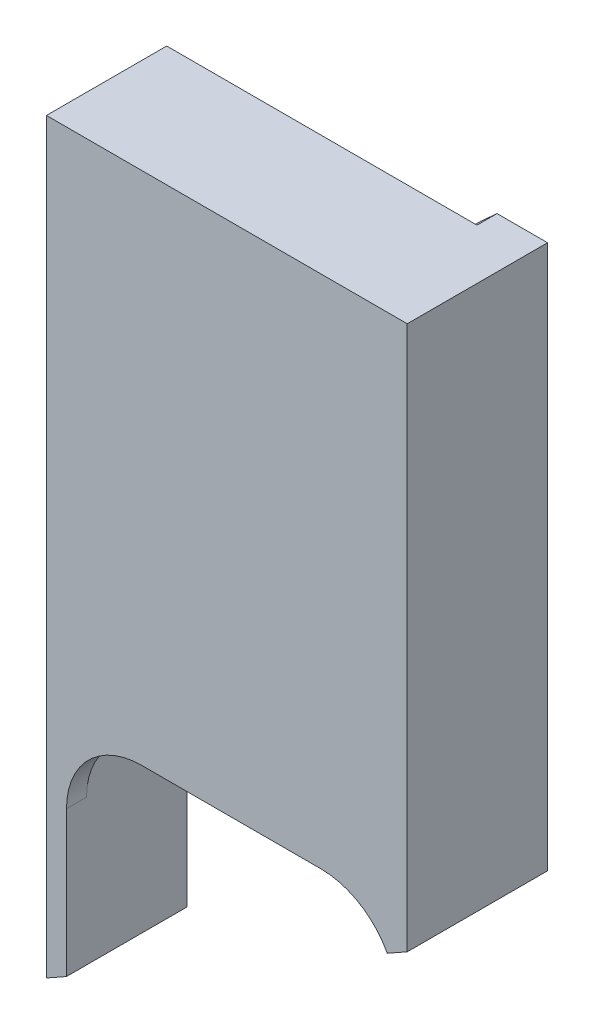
ISO-10303-21;
HEADER;
FILE_DESCRIPTION(('STEP AP214'),'2;1');
FILE_NAME('part.step','',(''),(''),'','','');
FILE_SCHEMA(('AUTOMOTIVE_DESIGN { 1 0 10303 214 1 1 1 1 }'));
ENDSEC;
DATA;
#1=APPLICATION_CONTEXT('core data for automotive mechanical design processes');
#2=APPLICATION_PROTOCOL_DEFINITION('international standard','automotive_design',2000,#1);
#3=PRODUCT_CONTEXT('',#1,'mechanical');
#4=PRODUCT('Part','Part','',(#3));
#5=PRODUCT_RELATED_PRODUCT_CATEGORY('part','',(#4));
#6=PRODUCT_DEFINITION_FORMATION('','',#4);
#7=PRODUCT_DEFINITION_CONTEXT('part definition',#1,'design');
#8=PRODUCT_DEFINITION('design','',#6,#7);
#9=PRODUCT_DEFINITION_SHAPE('','',#8);
#10=(LENGTH_UNIT() NAMED_UNIT(*) SI_UNIT(.MILLI.,.METRE.));
#11=(NAMED_UNIT(*) PLANE_ANGLE_UNIT() SI_UNIT($,.RADIAN.));
#12=(NAMED_UNIT(*) SI_UNIT($,.STERADIAN.) SOLID_ANGLE_UNIT());
#13=UNCERTAINTY_MEASURE_WITH_UNIT(LENGTH_MEASURE(1.E-05),#10,'distance_accuracy_value','');
#14=(GEOMETRIC_REPRESENTATION_CONTEXT(3) GLOBAL_UNCERTAINTY_ASSIGNED_CONTEXT((#13)) GLOBAL_UNIT_ASSIGNED_CONTEXT((#10,
#11,#12)) REPRESENTATION_CONTEXT('',''));
#15=CARTESIAN_POINT('',(0.,0.,0.));
#16=DIRECTION('',(0.,0.,1.));
#17=DIRECTION('',(1.,0.,0.));
#18=AXIS2_PLACEMENT_3D('',#15,#16,#17);
#19=CARTESIAN_POINT('',(-22.86,-94.6581864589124,-16.51));
#20=DIRECTION('',(-0.490481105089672,0.871451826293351,0.));
#21=DIRECTION('',(-0.871451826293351,-0.490481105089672,0.));
#22=AXIS2_PLACEMENT_3D('',#19,#20,#21);
#23=PLANE('',#22);
#24=DIRECTION('',(-0.871451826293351,-0.490481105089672,0.));
#25=VECTOR('',#24,1.);
#26=CARTESIAN_POINT('',(-22.86,-94.6581864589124,1.27000000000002));
#27=LINE('',#26,#25);
#28=CARTESIAN_POINT('',(22.86,-68.9255005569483,1.27000000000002));
#29=VERTEX_POINT('',#28);
#30=CARTESIAN_POINT('',(20.32,-70.3550942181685,1.27000000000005));
#31=VERTEX_POINT('',#30);
#32=EDGE_CURVE('E168',#29,#31,#27,.T.);
#33=ORIENTED_EDGE('',*,*,#32,.T.);
#34=DIRECTION('',(0.,0.,0.999999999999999));
#35=VECTOR('',#34,1.);
#36=CARTESIAN_POINT('',(20.32,-70.3550942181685,-13.97));
#37=LINE('',#36,#35);
#38=CARTESIAN_POINT('',(20.32,-70.3550942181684,-1.26999999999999));
#39=VERTEX_POINT('',#38);
#40=EDGE_CURVE('E179',#39,#31,#37,.T.);
#41=ORIENTED_EDGE('',*,*,#40,.F.);
#42=CARTESIAN_POINT('',(20.32,-70.3550942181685,-13.97));
#43=VERTEX_POINT('',#42);
#44=EDGE_CURVE('E188',#43,#39,#37,.T.);
#45=ORIENTED_EDGE('',*,*,#44,.F.);
#46=DIRECTION('',(0.871451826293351,0.490481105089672,0.));
#47=VECTOR('',#46,1.);
#48=CARTESIAN_POINT('',(55.7355757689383,-50.4220695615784,-13.97));
#49=LINE('',#48,#47);
#50=CARTESIAN_POINT('',(11.1720317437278,-75.5038648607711,-13.97));
#51=VERTEX_POINT('',#50);
#52=EDGE_CURVE('E189',#51,#43,#49,.T.);
#53=ORIENTED_EDGE('',*,*,#52,.F.);
#54=DIRECTION('',(0.,0.,1.));
#55=VECTOR('',#54,1.);
#56=CARTESIAN_POINT('',(11.1720317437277,-75.5038648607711,-16.51));
#57=LINE('',#56,#55);
#58=CARTESIAN_POINT('',(11.1720317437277,-75.5038648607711,-16.51));
#59=VERTEX_POINT('',#58);
#60=EDGE_CURVE('E193',#59,#51,#57,.T.);
#61=ORIENTED_EDGE('',*,*,#60,.F.);
#62=DIRECTION('',(-0.871451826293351,-0.490481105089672,0.));
#63=VECTOR('',#62,1.);
#64=CARTESIAN_POINT('',(-22.86,-94.6581864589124,-16.51));
#65=LINE('',#64,#63);
#66=CARTESIAN_POINT('',(22.86,-68.9255005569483,-16.51));
#67=VERTEX_POINT('',#66);
#68=EDGE_CURVE('E183',#67,#59,#65,.T.);
#69=ORIENTED_EDGE('',*,*,#68,.F.);
#70=DIRECTION('',(0.,0.,1.));
#71=VECTOR('',#70,1.);
#72=CARTESIAN_POINT('',(22.86,-68.9255005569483,-16.51));
#73=LINE('',#72,#71);
#74=EDGE_CURVE('E182',#67,#29,#73,.T.);
#75=ORIENTED_EDGE('',*,*,#74,.T.);
#76=EDGE_LOOP('',(#33,#41,#45,#53,#61,#69,#75));
#77=FACE_BOUND('',#76,.T.);
#78=ADVANCED_FACE('F34',(#77),#23,.F.);
#79=CARTESIAN_POINT('',(22.86,-57.1500000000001,-1.26999999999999));
#80=DIRECTION('',(0.,0.,1.));
#81=DIRECTION('',(0.,-1.,0.));
#82=AXIS2_PLACEMENT_3D('',#79,#80,#81);
#83=PLANE('',#82);
#84=DIRECTION('',(0.,1.,0.));
#85=VECTOR('',#84,1.);
#86=CARTESIAN_POINT('',(20.32,-2.54000000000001,-1.26999999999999));
#87=LINE('',#86,#85);
#88=CARTESIAN_POINT('',(20.32,-57.1500000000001,-1.26999999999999));
#89=VERTEX_POINT('',#88);
#90=EDGE_CURVE('E240',#39,#89,#87,.T.);
#91=ORIENTED_EDGE('',*,*,#90,.F.);
#92=CARTESIAN_POINT('',(11.9029093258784,-74.8135927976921,-1.26999999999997));
#93=DIRECTION('',(0.,0.,1.));
#94=DIRECTION('',(0.,-1.,0.));
#95=AXIS2_PLACEMENT_3D('',#92,#93,#94);
#96=CIRCLE('',#95,9.525);
#97=CARTESIAN_POINT('',(11.9029093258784,-65.2885927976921,-1.26999999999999));
#98=VERTEX_POINT('',#97);
#99=EDGE_CURVE('E175',#39,#98,#96,.T.);
#100=ORIENTED_EDGE('',*,*,#99,.T.);
#101=DIRECTION('',(1.,0.,0.));
#102=VECTOR('',#101,1.);
#103=CARTESIAN_POINT('',(-20.32,-65.2885927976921,-1.26999999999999));
#104=LINE('',#103,#102);
#105=CARTESIAN_POINT('',(-10.795,-65.2885927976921,-1.26999999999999));
#106=VERTEX_POINT('',#105);
#107=EDGE_CURVE('E306',#106,#98,#104,.T.);
#108=ORIENTED_EDGE('',*,*,#107,.F.);
#109=CARTESIAN_POINT('',(-10.795,-74.8135927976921,-1.26999999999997));
#110=DIRECTION('',(0.,0.,1.));
#111=DIRECTION('',(0.,-1.,0.));
#112=AXIS2_PLACEMENT_3D('',#109,#110,#111);
#113=CIRCLE('',#112,9.525);
#114=CARTESIAN_POINT('',(-20.32,-74.8135927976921,-1.26999999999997));
#115=VERTEX_POINT('',#114);
#116=EDGE_CURVE('E42',#106,#115,#113,.T.);
#117=ORIENTED_EDGE('',*,*,#116,.T.);
#118=DIRECTION('',(0.,-1.,0.));
#119=VECTOR('',#118,1.);
#120=CARTESIAN_POINT('',(-20.32,-107.95,-1.27000000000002));
#121=LINE('',#120,#119);
#122=CARTESIAN_POINT('',(-20.32,-57.1500000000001,-1.26999999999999));
#123=VERTEX_POINT('',#122);
#124=EDGE_CURVE('E49',#123,#115,#121,.T.);
#125=ORIENTED_EDGE('',*,*,#124,.F.);
#126=DIRECTION('',(-1.,0.,0.));
#127=VECTOR('',#126,1.);
#128=CARTESIAN_POINT('',(22.86,-57.1500000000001,-1.26999999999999));
#129=LINE('',#128,#127);
#130=EDGE_CURVE('E289',#89,#123,#129,.T.);
#131=ORIENTED_EDGE('',*,*,#130,.F.);
#132=EDGE_LOOP('',(#91,#100,#108,#117,#125,#131));
#133=FACE_BOUND('',#132,.T.);
#134=ADVANCED_FACE('F303',(#133),#83,.F.);
#135=CARTESIAN_POINT('',(22.86,-57.1500000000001,-3.17499999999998));
#136=DIRECTION('',(0.,1.,0.));
#137=DIRECTION('',(0.,0.,1.));
#138=AXIS2_PLACEMENT_3D('',#135,#136,#137);
#139=PLANE('',#138);
#140=DIRECTION('',(0.,0.,-1.));
#141=VECTOR('',#140,1.);
#142=CARTESIAN_POINT('',(20.32,-57.1500000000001,-3.17499999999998));
#143=LINE('',#142,#141);
#144=CARTESIAN_POINT('',(20.32,-57.1500000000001,-3.17499999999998));
#145=VERTEX_POINT('',#144);
#146=EDGE_CURVE('E266',#89,#145,#143,.T.);
#147=ORIENTED_EDGE('',*,*,#146,.F.);
#148=ORIENTED_EDGE('',*,*,#130,.T.);
#149=DIRECTION('',(0.,0.,1.));
#150=VECTOR('',#149,1.);
#151=CARTESIAN_POINT('',(-20.32,-57.1500000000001,-3.17499999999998));
#152=LINE('',#151,#150);
#153=CARTESIAN_POINT('',(-20.32,-57.1500000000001,-3.17499999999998));
#154=VERTEX_POINT('',#153);
#155=EDGE_CURVE('E258',#154,#123,#152,.T.);
#156=ORIENTED_EDGE('',*,*,#155,.F.);
#157=DIRECTION('',(-1.,0.,0.));
#158=VECTOR('',#157,1.);
#159=CARTESIAN_POINT('',(22.86,-57.1500000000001,-3.17499999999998));
#160=LINE('',#159,#158);
#161=EDGE_CURVE('E286',#145,#154,#160,.T.);
#162=ORIENTED_EDGE('',*,*,#161,.F.);
#163=EDGE_LOOP('',(#147,#148,#156,#162));
#164=FACE_BOUND('',#163,.T.);
#165=ADVANCED_FACE('F378',(#164),#139,.F.);
#166=CARTESIAN_POINT('',(22.86,-34.29,-3.17499999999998));
#167=DIRECTION('',(0.,0.,1.));
#168=DIRECTION('',(0.,-1.,0.));
#169=AXIS2_PLACEMENT_3D('',#166,#167,#168);
#170=PLANE('',#169);
#171=DIRECTION('',(0.,1.,0.));
#172=VECTOR('',#171,1.);
#173=CARTESIAN_POINT('',(20.32,-34.29,-3.17499999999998));
#174=LINE('',#173,#172);
#175=CARTESIAN_POINT('',(20.32,-34.29,-3.17499999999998));
#176=VERTEX_POINT('',#175);
#177=EDGE_CURVE('E263',#145,#176,#174,.T.);
#178=ORIENTED_EDGE('',*,*,#177,.F.);
#179=ORIENTED_EDGE('',*,*,#161,.T.);
#180=DIRECTION('',(0.,-1.,0.));
#181=VECTOR('',#180,1.);
#182=CARTESIAN_POINT('',(-20.32,-34.29,-3.17499999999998));
#183=LINE('',#182,#181);
#184=CARTESIAN_POINT('',(-20.32,-34.29,-3.17499999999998));
#185=VERTEX_POINT('',#184);
#186=EDGE_CURVE('E255',#185,#154,#183,.T.);
#187=ORIENTED_EDGE('',*,*,#186,.F.);
#188=DIRECTION('',(-1.,0.,0.));
#189=VECTOR('',#188,1.);
#190=CARTESIAN_POINT('',(22.86,-34.29,-3.17499999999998));
#191=LINE('',#190,#189);
#192=EDGE_CURVE('E283',#176,#185,#191,.T.);
#193=ORIENTED_EDGE('',*,*,#192,.F.);
#194=EDGE_LOOP('',(#178,#179,#187,#193));
#195=FACE_BOUND('',#194,.T.);
#196=ADVANCED_FACE('F374',(#195),#170,.F.);
#197=CARTESIAN_POINT('',(22.86,-34.29,-1.26999999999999));
#198=DIRECTION('',(0.,-1.,0.));
#199=DIRECTION('',(0.,0.,-1.));
#200=AXIS2_PLACEMENT_3D('',#197,#198,#199);
#201=PLANE('',#200);
#202=DIRECTION('',(0.,0.,1.));
#203=VECTOR('',#202,1.);
#204=CARTESIAN_POINT('',(20.32,-34.29,-1.26999999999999));
#205=LINE('',#204,#203);
#206=CARTESIAN_POINT('',(20.32,-34.29,-1.26999999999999));
#207=VERTEX_POINT('',#206);
#208=EDGE_CURVE('E260',#176,#207,#205,.T.);
#209=ORIENTED_EDGE('',*,*,#208,.F.);
#210=ORIENTED_EDGE('',*,*,#192,.T.);
#211=DIRECTION('',(0.,0.,-1.));
#212=VECTOR('',#211,1.);
#213=CARTESIAN_POINT('',(-20.32,-34.29,-1.26999999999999));
#214=LINE('',#213,#212);
#215=CARTESIAN_POINT('',(-20.32,-34.29,-1.26999999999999));
#216=VERTEX_POINT('',#215);
#217=EDGE_CURVE('E252',#216,#185,#214,.T.);
#218=ORIENTED_EDGE('',*,*,#217,.F.);
#219=DIRECTION('',(-1.,0.,0.));
#220=VECTOR('',#219,1.);
#221=CARTESIAN_POINT('',(22.86,-34.29,-1.26999999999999));
#222=LINE('',#221,#220);
#223=EDGE_CURVE('E276',#207,#216,#222,.T.);
#224=ORIENTED_EDGE('',*,*,#223,.F.);
#225=EDGE_LOOP('',(#209,#210,#218,#224));
#226=FACE_BOUND('',#225,.T.);
#227=ADVANCED_FACE('F372',(#226),#201,.F.);
#228=CARTESIAN_POINT('',(22.86,0.,-1.26999999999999));
#229=DIRECTION('',(0.,0.,1.));
#230=DIRECTION('',(0.,-1.,0.));
#231=AXIS2_PLACEMENT_3D('',#228,#229,#230);
#232=PLANE('',#231);
#233=CARTESIAN_POINT('',(20.32,-2.54000000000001,-1.26999999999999));
#234=VERTEX_POINT('',#233);
#235=EDGE_CURVE('E224',#207,#234,#87,.T.);
#236=ORIENTED_EDGE('',*,*,#235,.F.);
#237=ORIENTED_EDGE('',*,*,#223,.T.);
#238=CARTESIAN_POINT('',(-20.32,-2.54,-1.26999999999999));
#239=VERTEX_POINT('',#238);
#240=EDGE_CURVE('E228',#239,#216,#121,.T.);
#241=ORIENTED_EDGE('',*,*,#240,.F.);
#242=DIRECTION('',(-1.,0.,0.));
#243=VECTOR('',#242,1.);
#244=CARTESIAN_POINT('',(-20.32,-2.54,-1.26999999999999));
#245=LINE('',#244,#243);
#246=EDGE_CURVE('E242',#234,#239,#245,.T.);
#247=ORIENTED_EDGE('',*,*,#246,.F.);
#248=EDGE_LOOP('',(#236,#237,#241,#247));
#249=FACE_BOUND('',#248,.T.);
#250=ADVANCED_FACE('F366',(#249),#232,.F.);
#251=CARTESIAN_POINT('',(22.86,0.,1.27000000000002));
#252=DIRECTION('',(0.,-1.,0.));
#253=DIRECTION('',(0.,0.,-1.));
#254=AXIS2_PLACEMENT_3D('',#251,#252,#253);
#255=PLANE('',#254);
#256=DIRECTION('',(0.,0.,1.));
#257=VECTOR('',#256,1.);
#258=CARTESIAN_POINT('',(-22.86,0.,1.26999999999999));
#259=LINE('',#258,#257);
#260=CARTESIAN_POINT('',(-22.86,0.,-13.97));
#261=VERTEX_POINT('',#260);
#262=CARTESIAN_POINT('',(-22.86,0.,1.26999999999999));
#263=VERTEX_POINT('',#262);
#264=EDGE_CURVE('E269',#261,#263,#259,.T.);
#265=ORIENTED_EDGE('',*,*,#264,.T.);
#266=DIRECTION('',(-1.,0.,0.));
#267=VECTOR('',#266,1.);
#268=CARTESIAN_POINT('',(22.86,0.,1.27000000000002));
#269=LINE('',#268,#267);
#270=CARTESIAN_POINT('',(22.86,0.,1.27000000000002));
#271=VERTEX_POINT('',#270);
#272=EDGE_CURVE('E292',#271,#263,#269,.T.);
#273=ORIENTED_EDGE('',*,*,#272,.F.);
#274=DIRECTION('',(0.,0.,1.));
#275=VECTOR('',#274,1.);
#276=CARTESIAN_POINT('',(22.86,0.,1.27000000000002));
#277=LINE('',#276,#275);
#278=CARTESIAN_POINT('',(22.86,0.,-16.51));
#279=VERTEX_POINT('',#278);
#280=EDGE_CURVE('E270',#279,#271,#277,.T.);
#281=ORIENTED_EDGE('',*,*,#280,.F.);
#282=DIRECTION('',(1.,0.,0.));
#283=VECTOR('',#282,1.);
#284=CARTESIAN_POINT('',(22.86,0.,-16.51));
#285=LINE('',#284,#283);
#286=CARTESIAN_POINT('',(16.4584053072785,0.,-16.51));
#287=VERTEX_POINT('',#286);
#288=EDGE_CURVE('E208',#287,#279,#285,.T.);
#289=ORIENTED_EDGE('',*,*,#288,.F.);
#290=DIRECTION('',(0.,0.,1.));
#291=VECTOR('',#290,1.);
#292=CARTESIAN_POINT('',(16.4584053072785,0.,-16.51));
#293=LINE('',#292,#291);
#294=CARTESIAN_POINT('',(16.4584053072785,0.,-13.97));
#295=VERTEX_POINT('',#294);
#296=EDGE_CURVE('E214',#287,#295,#293,.T.);
#297=ORIENTED_EDGE('',*,*,#296,.T.);
#298=DIRECTION('',(1.,0.,0.));
#299=VECTOR('',#298,1.);
#300=CARTESIAN_POINT('',(22.86,0.,-13.97));
#301=LINE('',#300,#299);
#302=EDGE_CURVE('E237',#261,#295,#301,.T.);
#303=ORIENTED_EDGE('',*,*,#302,.F.);
#304=EDGE_LOOP('',(#265,#273,#281,#289,#297,#303));
#305=FACE_BOUND('',#304,.T.);
#306=ADVANCED_FACE('F349',(#305),#255,.F.);
#307=CARTESIAN_POINT('',(22.86,0.,1.27000000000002));
#308=DIRECTION('',(0.,0.,-1.));
#309=DIRECTION('',(0.,1.,0.));
#310=AXIS2_PLACEMENT_3D('',#307,#308,#309);
#311=PLANE('',#310);
#312=DIRECTION('',(0.,1.,0.));
#313=VECTOR('',#312,1.);
#314=CARTESIAN_POINT('',(-20.32,-93.2285927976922,1.27000000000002));
#315=LINE('',#314,#313);
#316=CARTESIAN_POINT('',(-20.32,-93.2285927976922,1.27000000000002));
#317=VERTEX_POINT('',#316);
#318=CARTESIAN_POINT('',(-20.32,-74.8135927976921,1.27000000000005));
#319=VERTEX_POINT('',#318);
#320=EDGE_CURVE('E311',#317,#319,#315,.T.);
#321=ORIENTED_EDGE('',*,*,#320,.T.);
#322=CARTESIAN_POINT('',(-10.795,-74.8135927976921,1.27000000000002));
#323=DIRECTION('',(0.,0.,-1.));
#324=DIRECTION('',(0.,1.,0.));
#325=AXIS2_PLACEMENT_3D('',#322,#323,#324);
#326=CIRCLE('',#325,9.525);
#327=CARTESIAN_POINT('',(-10.795,-65.2885927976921,1.27000000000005));
#328=VERTEX_POINT('',#327);
#329=EDGE_CURVE('E11',#319,#328,#326,.T.);
#330=ORIENTED_EDGE('',*,*,#329,.T.);
#331=DIRECTION('',(1.,0.,0.));
#332=VECTOR('',#331,1.);
#333=CARTESIAN_POINT('',(-20.32,-65.2885927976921,1.27000000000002));
#334=LINE('',#333,#332);
#335=CARTESIAN_POINT('',(11.9029093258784,-65.2885927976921,1.27000000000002));
#336=VERTEX_POINT('',#335);
#337=EDGE_CURVE('E171',#328,#336,#334,.T.);
#338=ORIENTED_EDGE('',*,*,#337,.T.);
#339=CARTESIAN_POINT('',(11.9029093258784,-74.8135927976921,1.27000000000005));
#340=DIRECTION('',(0.,0.,-1.));
#341=DIRECTION('',(0.,1.,0.));
#342=AXIS2_PLACEMENT_3D('',#339,#340,#341);
#343=CIRCLE('',#342,9.525);
#344=EDGE_CURVE('E165',#336,#31,#343,.T.);
#345=ORIENTED_EDGE('',*,*,#344,.T.);
#346=ORIENTED_EDGE('',*,*,#32,.F.);
#347=DIRECTION('',(0.,-1.,0.));
#348=VECTOR('',#347,1.);
#349=CARTESIAN_POINT('',(22.86,0.,1.27000000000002));
#350=LINE('',#349,#348);
#351=EDGE_CURVE('E273',#271,#29,#350,.T.);
#352=ORIENTED_EDGE('',*,*,#351,.F.);
#353=ORIENTED_EDGE('',*,*,#272,.T.);
#354=DIRECTION('',(0.,-1.,0.));
#355=VECTOR('',#354,1.);
#356=CARTESIAN_POINT('',(-22.86,0.,1.26999999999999));
#357=LINE('',#356,#355);
#358=CARTESIAN_POINT('',(-22.86,-94.6581864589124,1.27000000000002));
#359=VERTEX_POINT('',#358);
#360=EDGE_CURVE('E274',#263,#359,#357,.T.);
#361=ORIENTED_EDGE('',*,*,#360,.T.);
#362=EDGE_CURVE('E184',#317,#359,#27,.T.);
#363=ORIENTED_EDGE('',*,*,#362,.F.);
#364=EDGE_LOOP('',(#321,#330,#338,#345,#346,#352,#353,#361,#363));
#365=FACE_BOUND('',#364,.T.);
#366=ADVANCED_FACE('F167',(#365),#311,.F.);
#367=CARTESIAN_POINT('',(22.86,0.,0.));
#368=DIRECTION('',(-1.,0.,0.));
#369=DIRECTION('',(0.,0.,1.));
#370=AXIS2_PLACEMENT_3D('',#367,#368,#369);
#371=PLANE('',#370);
#372=ORIENTED_EDGE('',*,*,#351,.T.);
#373=ORIENTED_EDGE('',*,*,#74,.F.);
#374=DIRECTION('',(0.,-1.,0.));
#375=VECTOR('',#374,1.);
#376=CARTESIAN_POINT('',(22.86,-107.95,-16.51));
#377=LINE('',#376,#375);
#378=EDGE_CURVE('E211',#279,#67,#377,.T.);
#379=ORIENTED_EDGE('',*,*,#378,.F.);
#380=ORIENTED_EDGE('',*,*,#280,.T.);
#381=EDGE_LOOP('',(#372,#373,#379,#380));
#382=FACE_BOUND('',#381,.T.);
#383=ADVANCED_FACE('F344',(#382),#371,.F.);
#384=CARTESIAN_POINT('',(-22.86,0.,0.));
#385=DIRECTION('',(-1.,0.,0.));
#386=DIRECTION('',(0.,0.,1.));
#387=AXIS2_PLACEMENT_3D('',#384,#385,#386);
#388=PLANE('',#387);
#389=DIRECTION('',(0.,0.,1.));
#390=VECTOR('',#389,1.);
#391=CARTESIAN_POINT('',(-22.86,-94.6581864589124,-16.51));
#392=LINE('',#391,#390);
#393=CARTESIAN_POINT('',(-22.86,-94.6581864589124,-13.97));
#394=VERTEX_POINT('',#393);
#395=EDGE_CURVE('E320',#394,#359,#392,.T.);
#396=ORIENTED_EDGE('',*,*,#395,.T.);
#397=ORIENTED_EDGE('',*,*,#360,.F.);
#398=ORIENTED_EDGE('',*,*,#264,.F.);
#399=DIRECTION('',(0.,1.,0.));
#400=VECTOR('',#399,1.);
#401=CARTESIAN_POINT('',(-22.86,0.,-13.97));
#402=LINE('',#401,#400);
#403=EDGE_CURVE('E235',#394,#261,#402,.T.);
#404=ORIENTED_EDGE('',*,*,#403,.F.);
#405=EDGE_LOOP('',(#396,#397,#398,#404));
#406=FACE_BOUND('',#405,.T.);
#407=ADVANCED_FACE('F352',(#406),#388,.T.);
#408=CARTESIAN_POINT('',(20.32,-2.54000000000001,-13.97));
#409=DIRECTION('',(1.,0.,0.));
#410=DIRECTION('',(0.,1.,0.));
#411=AXIS2_PLACEMENT_3D('',#408,#409,#410);
#412=PLANE('',#411);
#413=ORIENTED_EDGE('',*,*,#44,.T.);
#414=ORIENTED_EDGE('',*,*,#90,.T.);
#415=ORIENTED_EDGE('',*,*,#146,.T.);
#416=ORIENTED_EDGE('',*,*,#177,.T.);
#417=ORIENTED_EDGE('',*,*,#208,.T.);
#418=ORIENTED_EDGE('',*,*,#235,.T.);
#419=DIRECTION('',(0.,0.,1.));
#420=VECTOR('',#419,1.);
#421=CARTESIAN_POINT('',(20.32,-2.54000000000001,-13.97));
#422=LINE('',#421,#420);
#423=CARTESIAN_POINT('',(20.32,-2.54000000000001,-13.97));
#424=VERTEX_POINT('',#423);
#425=EDGE_CURVE('E249',#424,#234,#422,.T.);
#426=ORIENTED_EDGE('',*,*,#425,.F.);
#427=DIRECTION('',(0.,1.,0.));
#428=VECTOR('',#427,1.);
#429=CARTESIAN_POINT('',(20.32,-2.54000000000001,-13.97));
#430=LINE('',#429,#428);
#431=EDGE_CURVE('E225',#43,#424,#430,.T.);
#432=ORIENTED_EDGE('',*,*,#431,.F.);
#433=EDGE_LOOP('',(#413,#414,#415,#416,#417,#418,#426,#432));
#434=FACE_BOUND('',#433,.T.);
#435=ADVANCED_FACE('F369',(#434),#412,.F.);
#436=CARTESIAN_POINT('',(-20.32,-107.95,-13.97));
#437=DIRECTION('',(-1.,0.,0.));
#438=DIRECTION('',(0.,0.,1.));
#439=AXIS2_PLACEMENT_3D('',#436,#437,#438);
#440=PLANE('',#439);
#441=ORIENTED_EDGE('',*,*,#124,.T.);
#442=DIRECTION('',(0.,0.,-1.));
#443=VECTOR('',#442,1.);
#444=CARTESIAN_POINT('',(-20.32,-74.8135927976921,1.27000000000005));
#445=LINE('',#444,#443);
#446=EDGE_CURVE('E54',#115,#319,#445,.F.);
#447=ORIENTED_EDGE('',*,*,#446,.T.);
#448=ORIENTED_EDGE('',*,*,#320,.F.);
#449=DIRECTION('',(0.,0.,-0.999999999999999));
#450=VECTOR('',#449,1.);
#451=CARTESIAN_POINT('',(-20.32,-93.2285927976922,-13.97));
#452=LINE('',#451,#450);
#453=CARTESIAN_POINT('',(-20.32,-93.2285927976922,-13.97));
#454=VERTEX_POINT('',#453);
#455=EDGE_CURVE('E191',#317,#454,#452,.T.);
#456=ORIENTED_EDGE('',*,*,#455,.T.);
#457=DIRECTION('',(0.,-1.,0.));
#458=VECTOR('',#457,1.);
#459=CARTESIAN_POINT('',(-20.32,-107.95,-13.97));
#460=LINE('',#459,#458);
#461=CARTESIAN_POINT('',(-20.32,-2.53999999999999,-13.97));
#462=VERTEX_POINT('',#461);
#463=EDGE_CURVE('E232',#462,#454,#460,.T.);
#464=ORIENTED_EDGE('',*,*,#463,.F.);
#465=DIRECTION('',(0.,0.,1.));
#466=VECTOR('',#465,1.);
#467=CARTESIAN_POINT('',(-20.32,-2.53999999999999,-13.97));
#468=LINE('',#467,#466);
#469=EDGE_CURVE('E239',#462,#239,#468,.T.);
#470=ORIENTED_EDGE('',*,*,#469,.T.);
#471=ORIENTED_EDGE('',*,*,#240,.T.);
#472=ORIENTED_EDGE('',*,*,#217,.T.);
#473=ORIENTED_EDGE('',*,*,#186,.T.);
#474=ORIENTED_EDGE('',*,*,#155,.T.);
#475=EDGE_LOOP('',(#441,#447,#448,#456,#464,#470,#471,#472,#473,#474));
#476=FACE_BOUND('',#475,.T.);
#477=ADVANCED_FACE('F360',(#476),#440,.F.);
#478=CARTESIAN_POINT('',(-20.32,-2.53999999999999,-13.97));
#479=DIRECTION('',(0.,1.,0.));
#480=DIRECTION('',(-1.,0.,0.));
#481=AXIS2_PLACEMENT_3D('',#478,#479,#480);
#482=PLANE('',#481);
#483=ORIENTED_EDGE('',*,*,#246,.T.);
#484=ORIENTED_EDGE('',*,*,#469,.F.);
#485=DIRECTION('',(-1.,0.,0.));
#486=VECTOR('',#485,1.);
#487=CARTESIAN_POINT('',(-20.32,-2.53999999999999,-13.97));
#488=LINE('',#487,#486);
#489=CARTESIAN_POINT('',(13.7120474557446,-2.54000000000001,-13.97));
#490=VERTEX_POINT('',#489);
#491=EDGE_CURVE('E227',#490,#462,#488,.T.);
#492=ORIENTED_EDGE('',*,*,#491,.F.);
#493=EDGE_CURVE('E229',#424,#490,#488,.T.);
#494=ORIENTED_EDGE('',*,*,#493,.F.);
#495=ORIENTED_EDGE('',*,*,#425,.T.);
#496=EDGE_LOOP('',(#483,#484,#492,#494,#495));
#497=FACE_BOUND('',#496,.T.);
#498=ADVANCED_FACE('F362',(#497),#482,.F.);
#499=CARTESIAN_POINT('',(0.,0.,-13.97));
#500=DIRECTION('',(0.,0.,1.));
#501=DIRECTION('',(0.,-1.,0.));
#502=AXIS2_PLACEMENT_3D('',#499,#500,#501);
#503=PLANE('',#502);
#504=ORIENTED_EDGE('',*,*,#463,.T.);
#505=DIRECTION('',(-0.871451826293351,-0.490481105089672,0.));
#506=VECTOR('',#505,1.);
#507=CARTESIAN_POINT('',(34.9603412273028,-62.1150394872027,-13.97));
#508=LINE('',#507,#506);
#509=EDGE_CURVE('E199',#454,#394,#508,.T.);
#510=ORIENTED_EDGE('',*,*,#509,.T.);
#511=ORIENTED_EDGE('',*,*,#403,.T.);
#512=ORIENTED_EDGE('',*,*,#302,.T.);
#513=CARTESIAN_POINT('',(48.2599999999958,-37.1400000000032,-13.97));
#514=DIRECTION('',(0.,0.,-1.));
#515=DIRECTION('',(0.,1.,0.));
#516=AXIS2_PLACEMENT_3D('',#513,#514,#515);
#517=CIRCLE('',#516,48.8950000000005);
#518=EDGE_CURVE('E218',#490,#295,#517,.T.);
#519=ORIENTED_EDGE('',*,*,#518,.F.);
#520=ORIENTED_EDGE('',*,*,#491,.T.);
#521=EDGE_LOOP('',(#504,#510,#511,#512,#519,#520));
#522=FACE_BOUND('',#521,.T.);
#523=ADVANCED_FACE('F356',(#522),#503,.F.);
#524=CARTESIAN_POINT('',(48.2599999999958,-37.1400000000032,-13.97));
#525=DIRECTION('',(0.,0.,-1.));
#526=DIRECTION('',(0.,1.,0.));
#527=AXIS2_PLACEMENT_3D('',#524,#525,#526);
#528=PLANE('',#527);
#529=DIRECTION('',(-0.271363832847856,0.962476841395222,0.));
#530=VECTOR('',#529,1.);
#531=CARTESIAN_POINT('',(20.32,-107.95,-13.97));
#532=LINE('',#531,#530);
#533=CARTESIAN_POINT('',(8.29965763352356,-65.3160902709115,-13.97));
#534=VERTEX_POINT('',#533);
#535=EDGE_CURVE('E202',#51,#534,#532,.T.);
#536=ORIENTED_EDGE('',*,*,#535,.F.);
#537=ORIENTED_EDGE('',*,*,#52,.T.);
#538=ORIENTED_EDGE('',*,*,#431,.T.);
#539=ORIENTED_EDGE('',*,*,#493,.T.);
#540=EDGE_CURVE('E206',#534,#490,#517,.T.);
#541=ORIENTED_EDGE('',*,*,#540,.F.);
#542=EDGE_LOOP('',(#536,#537,#538,#539,#541));
#543=FACE_BOUND('',#542,.T.);
#544=ADVANCED_FACE('F331',(#543),#528,.F.);
#545=CARTESIAN_POINT('',(20.32,-107.95,-16.51));
#546=DIRECTION('',(0.962476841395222,0.271363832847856,0.));
#547=DIRECTION('',(-0.271363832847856,0.962476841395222,0.));
#548=AXIS2_PLACEMENT_3D('',#545,#546,#547);
#549=PLANE('',#548);
#550=DIRECTION('',(-0.271363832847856,0.962476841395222,0.));
#551=VECTOR('',#550,1.);
#552=CARTESIAN_POINT('',(20.32,-107.95,-16.51));
#553=LINE('',#552,#551);
#554=CARTESIAN_POINT('',(8.29965763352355,-65.3160902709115,-16.51));
#555=VERTEX_POINT('',#554);
#556=EDGE_CURVE('E203',#59,#555,#553,.T.);
#557=ORIENTED_EDGE('',*,*,#556,.F.);
#558=ORIENTED_EDGE('',*,*,#60,.T.);
#559=ORIENTED_EDGE('',*,*,#535,.T.);
#560=DIRECTION('',(0.,0.,1.));
#561=VECTOR('',#560,1.);
#562=CARTESIAN_POINT('',(8.29965763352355,-65.3160902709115,-16.51));
#563=LINE('',#562,#561);
#564=EDGE_CURVE('E221',#555,#534,#563,.T.);
#565=ORIENTED_EDGE('',*,*,#564,.F.);
#566=EDGE_LOOP('',(#557,#558,#559,#565));
#567=FACE_BOUND('',#566,.T.);
#568=ADVANCED_FACE('F327',(#567),#549,.F.);
#569=CARTESIAN_POINT('',(48.2599999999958,-37.1400000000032,-16.51));
#570=DIRECTION('',(0.,0.,1.));
#571=DIRECTION('',(0.,-1.,0.));
#572=AXIS2_PLACEMENT_3D('',#569,#570,#571);
#573=CYLINDRICAL_SURFACE('',#572,48.8950000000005);
#574=ORIENTED_EDGE('',*,*,#540,.T.);
#575=ORIENTED_EDGE('',*,*,#518,.T.);
#576=ORIENTED_EDGE('',*,*,#296,.F.);
#577=CARTESIAN_POINT('',(48.2599999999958,-37.1400000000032,-16.51));
#578=DIRECTION('',(0.,0.,-1.));
#579=DIRECTION('',(0.,1.,0.));
#580=AXIS2_PLACEMENT_3D('',#577,#578,#579);
#581=CIRCLE('',#580,48.8950000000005);
#582=EDGE_CURVE('E205',#555,#287,#581,.T.);
#583=ORIENTED_EDGE('',*,*,#582,.F.);
#584=ORIENTED_EDGE('',*,*,#564,.T.);
#585=EDGE_LOOP('',(#574,#575,#576,#583,#584));
#586=FACE_BOUND('',#585,.T.);
#587=ADVANCED_FACE('F337',(#586),#573,.T.);
#588=CARTESIAN_POINT('',(48.2599999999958,-37.1400000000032,-16.51));
#589=DIRECTION('',(0.,0.,-1.));
#590=DIRECTION('',(0.,1.,0.));
#591=AXIS2_PLACEMENT_3D('',#588,#589,#590);
#592=PLANE('',#591);
#593=ORIENTED_EDGE('',*,*,#68,.T.);
#594=ORIENTED_EDGE('',*,*,#556,.T.);
#595=ORIENTED_EDGE('',*,*,#582,.T.);
#596=ORIENTED_EDGE('',*,*,#288,.T.);
#597=ORIENTED_EDGE('',*,*,#378,.T.);
#598=EDGE_LOOP('',(#593,#594,#595,#596,#597));
#599=FACE_BOUND('',#598,.T.);
#600=ADVANCED_FACE('F341',(#599),#592,.T.);
#601=ORIENTED_EDGE('',*,*,#455,.F.);
#602=ORIENTED_EDGE('',*,*,#362,.T.);
#603=ORIENTED_EDGE('',*,*,#395,.F.);
#604=ORIENTED_EDGE('',*,*,#509,.F.);
#605=EDGE_LOOP('',(#601,#602,#603,#604));
#606=FACE_BOUND('',#605,.T.);
#607=ADVANCED_FACE('F354',(#606),#23,.F.);
#608=CARTESIAN_POINT('',(-20.32,-65.2885927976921,1.27000000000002));
#609=DIRECTION('',(0.,1.,0.));
#610=DIRECTION('',(0.,0.,1.));
#611=AXIS2_PLACEMENT_3D('',#608,#609,#610);
#612=PLANE('',#611);
#613=ORIENTED_EDGE('',*,*,#107,.T.);
#614=DIRECTION('',(0.,0.,1.));
#615=VECTOR('',#614,1.);
#616=CARTESIAN_POINT('',(11.9029093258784,-65.2885927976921,1.27000000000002));
#617=LINE('',#616,#615);
#618=EDGE_CURVE('E298',#98,#336,#617,.T.);
#619=ORIENTED_EDGE('',*,*,#618,.T.);
#620=ORIENTED_EDGE('',*,*,#337,.F.);
#621=DIRECTION('',(0.,0.,-1.));
#622=VECTOR('',#621,1.);
#623=CARTESIAN_POINT('',(-10.795,-65.2885927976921,-1.26999999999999));
#624=LINE('',#623,#622);
#625=EDGE_CURVE('E295',#328,#106,#624,.T.);
#626=ORIENTED_EDGE('',*,*,#625,.T.);
#627=EDGE_LOOP('',(#613,#619,#620,#626));
#628=FACE_BOUND('',#627,.T.);
#629=ADVANCED_FACE('F313',(#628),#612,.F.);
#630=CARTESIAN_POINT('',(11.9029093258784,-74.8135927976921,-13.97));
#631=DIRECTION('',(0.,0.,0.999999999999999));
#632=DIRECTION('',(1.,0.,0.));
#633=AXIS2_PLACEMENT_3D('',#630,#631,#632);
#634=CYLINDRICAL_SURFACE('',#633,9.525);
#635=ORIENTED_EDGE('',*,*,#344,.F.);
#636=ORIENTED_EDGE('',*,*,#618,.F.);
#637=ORIENTED_EDGE('',*,*,#99,.F.);
#638=ORIENTED_EDGE('',*,*,#40,.T.);
#639=EDGE_LOOP('',(#635,#636,#637,#638));
#640=FACE_BOUND('',#639,.T.);
#641=ADVANCED_FACE('F187',(#640),#634,.F.);
#642=CARTESIAN_POINT('',(-10.795,-74.8135927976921,1.27000000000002));
#643=DIRECTION('',(0.,0.,1.));
#644=DIRECTION('',(0.,-1.,0.));
#645=AXIS2_PLACEMENT_3D('',#642,#643,#644);
#646=CYLINDRICAL_SURFACE('',#645,9.525);
#647=ORIENTED_EDGE('',*,*,#329,.F.);
#648=ORIENTED_EDGE('',*,*,#446,.F.);
#649=ORIENTED_EDGE('',*,*,#116,.F.);
#650=ORIENTED_EDGE('',*,*,#625,.F.);
#651=EDGE_LOOP('',(#647,#648,#649,#650));
#652=FACE_BOUND('',#651,.T.);
#653=ADVANCED_FACE('F36',(#652),#646,.F.);
#654=CLOSED_SHELL('',(#78,#134,#165,#196,#227,#250,#306,#366,#383,#407,#435,#477,#498,#523,#544,
#568,#587,#600,#607,#629,#641,#653));
#655=MANIFOLD_SOLID_BREP('B2',#654);
#656=ADVANCED_BREP_SHAPE_REPRESENTATION('',(#18,#655),#14);
#657=SHAPE_DEFINITION_REPRESENTATION(#9,#656);
ENDSEC;
END-ISO-10303-21;
